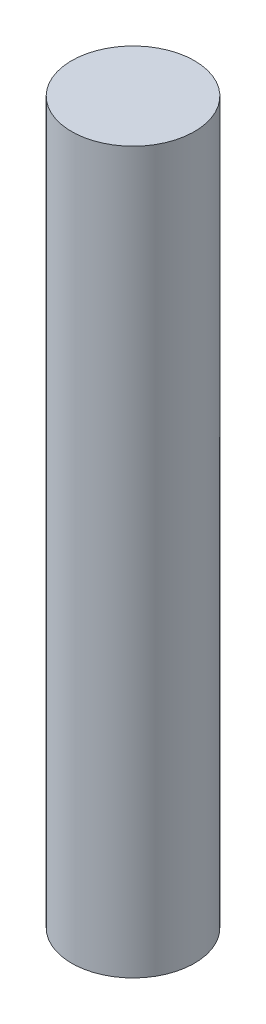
ISO-10303-21;
HEADER;
FILE_DESCRIPTION(('STEP AP214'),'2;1');
FILE_NAME('part.step','',(''),(''),'','','');
FILE_SCHEMA(('AUTOMOTIVE_DESIGN { 1 0 10303 214 1 1 1 1 }'));
ENDSEC;
DATA;
#1=APPLICATION_CONTEXT('core data for automotive mechanical design processes');
#2=APPLICATION_PROTOCOL_DEFINITION('international standard','automotive_design',2000,#1);
#3=PRODUCT_CONTEXT('',#1,'mechanical');
#4=PRODUCT('Part','Part','',(#3));
#5=PRODUCT_RELATED_PRODUCT_CATEGORY('part','',(#4));
#6=PRODUCT_DEFINITION_FORMATION('','',#4);
#7=PRODUCT_DEFINITION_CONTEXT('part definition',#1,'design');
#8=PRODUCT_DEFINITION('design','',#6,#7);
#9=PRODUCT_DEFINITION_SHAPE('','',#8);
#10=(LENGTH_UNIT() NAMED_UNIT(*) SI_UNIT(.MILLI.,.METRE.));
#11=(NAMED_UNIT(*) PLANE_ANGLE_UNIT() SI_UNIT($,.RADIAN.));
#12=(NAMED_UNIT(*) SI_UNIT($,.STERADIAN.) SOLID_ANGLE_UNIT());
#13=UNCERTAINTY_MEASURE_WITH_UNIT(LENGTH_MEASURE(1.E-05),#10,'distance_accuracy_value','');
#14=(GEOMETRIC_REPRESENTATION_CONTEXT(3) GLOBAL_UNCERTAINTY_ASSIGNED_CONTEXT((#13)) GLOBAL_UNIT_ASSIGNED_CONTEXT((#10,
#11,#12)) REPRESENTATION_CONTEXT('',''));
#15=CARTESIAN_POINT('',(0.,0.,0.));
#16=DIRECTION('',(0.,0.,1.));
#17=DIRECTION('',(1.,0.,0.));
#18=AXIS2_PLACEMENT_3D('',#15,#16,#17);
#19=CARTESIAN_POINT('',(0.,17.59,0.));
#20=DIRECTION('',(0.,1.,0.));
#21=DIRECTION('',(0.,0.,1.));
#22=AXIS2_PLACEMENT_3D('',#19,#20,#21);
#23=PLANE('',#22);
#24=CARTESIAN_POINT('',(0.,17.59,0.));
#25=DIRECTION('',(0.,-1.,0.));
#26=DIRECTION('',(0.,0.,-1.));
#27=AXIS2_PLACEMENT_3D('',#24,#25,#26);
#28=CIRCLE('',#27,1.5);
#29=CARTESIAN_POINT('',(0.,17.59,-1.5));
#30=VERTEX_POINT('',#29);
#31=EDGE_CURVE('E10',#30,#30,#28,.T.);
#32=ORIENTED_EDGE('',*,*,#31,.F.);
#33=EDGE_LOOP('',(#32));
#34=FACE_BOUND('',#33,.T.);
#35=ADVANCED_FACE('F32',(#34),#23,.T.);
#36=CARTESIAN_POINT('',(0.,0.,0.));
#37=DIRECTION('',(0.,-1.,0.));
#38=DIRECTION('',(0.,0.,-1.));
#39=AXIS2_PLACEMENT_3D('',#36,#37,#38);
#40=CYLINDRICAL_SURFACE('',#39,1.5);
#41=ORIENTED_EDGE('',*,*,#31,.T.);
#42=EDGE_LOOP('',(#41));
#43=FACE_BOUND('',#42,.T.);
#44=CARTESIAN_POINT('',(0.,0.,0.));
#45=DIRECTION('',(0.,-1.,0.));
#46=DIRECTION('',(0.,0.,-1.));
#47=AXIS2_PLACEMENT_3D('',#44,#45,#46);
#48=CIRCLE('',#47,1.5);
#49=CARTESIAN_POINT('',(0.,0.,-1.5));
#50=VERTEX_POINT('',#49);
#51=EDGE_CURVE('E38',#50,#50,#48,.T.);
#52=ORIENTED_EDGE('',*,*,#51,.F.);
#53=EDGE_LOOP('',(#52));
#54=FACE_BOUND('',#53,.T.);
#55=ADVANCED_FACE('F46',(#43,#54),#40,.T.);
#56=CARTESIAN_POINT('',(1.5,0.,0.));
#57=DIRECTION('',(0.,-1.,0.));
#58=DIRECTION('',(0.,0.,-1.));
#59=AXIS2_PLACEMENT_3D('',#56,#57,#58);
#60=PLANE('',#59);
#61=ORIENTED_EDGE('',*,*,#51,.T.);
#62=EDGE_LOOP('',(#61));
#63=FACE_BOUND('',#62,.T.);
#64=ADVANCED_FACE('F44',(#63),#60,.T.);
#65=CLOSED_SHELL('',(#35,#55,#64));
#66=MANIFOLD_SOLID_BREP('B2',#65);
#67=ADVANCED_BREP_SHAPE_REPRESENTATION('',(#18,#66),#14);
#68=SHAPE_DEFINITION_REPRESENTATION(#9,#67);
ENDSEC;
END-ISO-10303-21;
